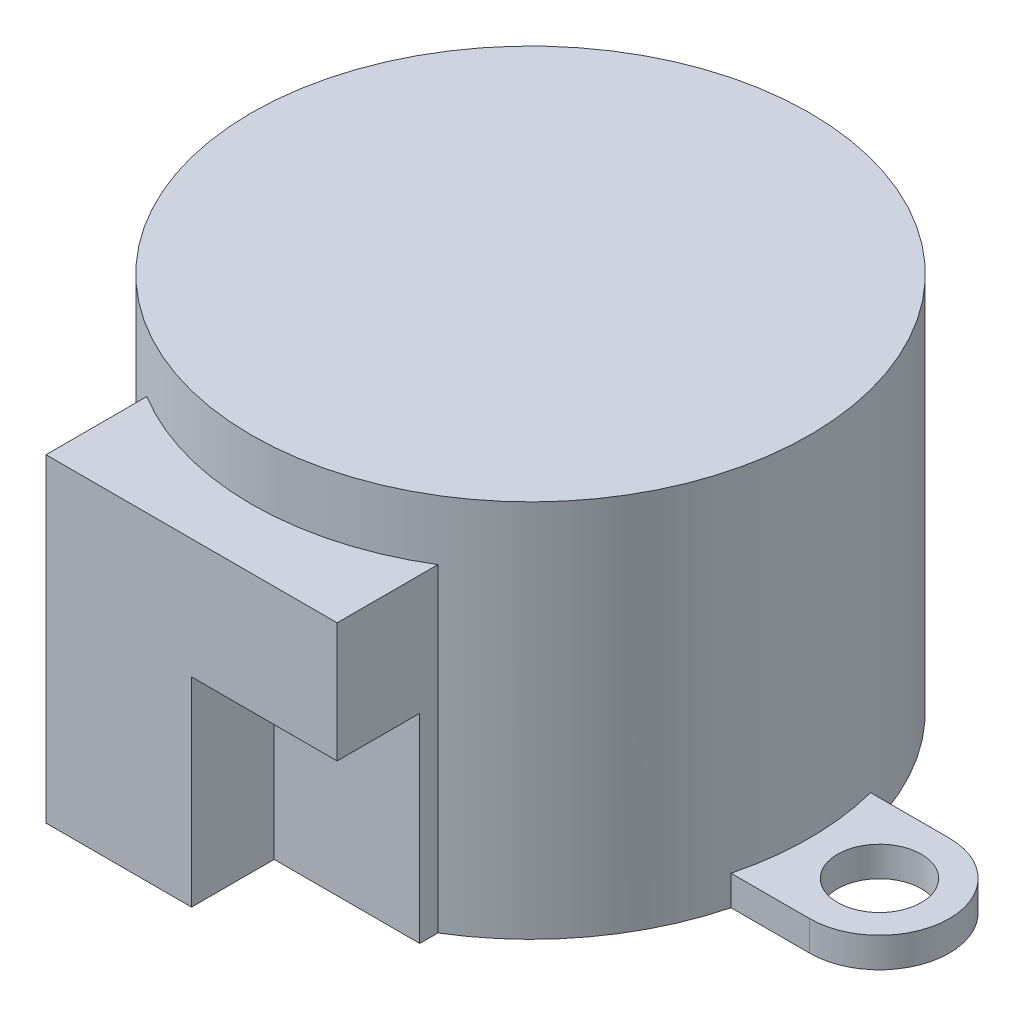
from build123d import *
from build123d.topology import SkipClean

# Parameters (mm, degrees)
BOSS_EXTRUDE1_DEPTH = 19
CUT_EXTRUDE1_START  = -3
CUT_EXTRUDE1_DEPTH  = 3
SKETCH3_R           = 2.1
BOSS_EXTRUDE2_DEPTH = 1.5
SKETCH5_W           = 7.3
SKETCH5_H           = 4.143386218
CUT_EXTRUDE2_DEPTH  = 10


with BuildPart() as part:
    # Sketch1 → Boss-Extrude1 (new body)
    with BuildSketch(Plane(origin=(0, 0, 0), x_dir=(1, 0, 0), z_dir=(0, 1, 0))):
        with BuildLine():
            Line((-7.3, -11.94612908), (-7.3, -17))
            Line((-7.3, -17), (7.3, -17))
            Line((7.3, -17), (7.3, -11.94612908))
            ThreePointArc((7.3, -11.94612908), (0, 14), (-7.3, -11.94612908))
        make_face()
    extrude(amount=BOSS_EXTRUDE1_DEPTH)

    # Sketch2 → Cut-Extrude1 (cut)
    with SkipClean():  # the faces are left unmerged after this step: merging them gives an invalid solid
        with BuildSketch(Plane(origin=(0, 19, 0), x_dir=(1, 0, 0), z_dir=(0, 1, 0)).offset(CUT_EXTRUDE1_START)):
            with BuildLine():
                Line((-7.3, -11.94612908), (-7.3, -17))
                Line((-7.3, -17), (7.3, -17))
                Line((7.3, -17), (7.3, -11.94612908))
                ThreePointArc((7.3, -11.94612908), (0, -14), (-7.3, -11.94612908))
            make_face()
        extrude(amount=CUT_EXTRUDE1_DEPTH, mode=Mode.SUBTRACT)

    # Sketch3 → Boss-Extrude2 (add)
    # profile 1 of 2: a face of its own
    with SkipClean():  # the faces are left unmerged after this step: merging them gives an invalid solid
        with BuildSketch(Plane.XZ):
            with BuildLine():
                Line((-13.555441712, 3.5), (-17.5, 3.5))
                ThreePointArc((-17.5, 3.5), (-21, 0), (-17.5, -3.5))
                Line((-17.5, -3.5), (-13.555441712, -3.5))
                ThreePointArc((-13.555441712, -3.5), (-13.888415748, -1.764060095), (-14, 0))
                ThreePointArc((-14, 0), (-13.888415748, 1.764060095), (-13.555441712, 3.5))
            make_face()
            with Locations(Location((-17.5, 0, 0), (0, 0, 270))):
                Circle(SKETCH3_R, mode=Mode.SUBTRACT)
        # profile 2 of 2: a face of its own
        with BuildSketch(Plane.XZ):
            with BuildLine():
                ThreePointArc((14, 0), (13.888415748, -1.764060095), (13.555441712, -3.5))
                Line((13.555441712, -3.5), (17.5, -3.5))
                ThreePointArc((17.5, -3.5), (21, 0), (17.5, 3.5))
                Line((17.5, 3.5), (13.555441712, 3.5))
                ThreePointArc((13.555441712, 3.5), (13.888415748, 1.764060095), (14, 0))
            make_face()
            with Locations(Location((17.5, 0, 0), (0, 0, 270))):
                Circle(SKETCH3_R, mode=Mode.SUBTRACT)
        extrude(amount=-BOSS_EXTRUDE2_DEPTH)

    # Sketch4 → Revolve1 (revolve)
    with SkipClean():  # the faces are left unmerged after this step: merging them gives an invalid solid
        with BuildSketch(Plane(origin=(0, 0, -8), x_dir=(-1, 0, 0), z_dir=(0, 0, -1)), mode=Mode.PRIVATE) as revolve1_sk:
            Polygon((0, 0), (0, -10), (-1.5, -10), (-1.5, -4), (-2.5, -4), (-2.5, -1.5), (-4.5, -1.5), (-4.5, 0), align=None)
        revolve(revolve1_sk.sketch.rotate(Axis((0, 0, -8), (0, -1, 0)), 180), axis=Axis((0, 0, -8), (0, -1, 0)))

    # Sketch5 → Cut-Extrude2 (cut)
    with SkipClean():  # the faces are left unmerged after this step: merging them gives an invalid solid
        with BuildSketch(Plane.XZ):
            with Locations((3.65, 14.928306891)):
                Rectangle(SKETCH5_W, SKETCH5_H)
        extrude(amount=-CUT_EXTRUDE2_DEPTH, mode=Mode.SUBTRACT)


solid = part.part
